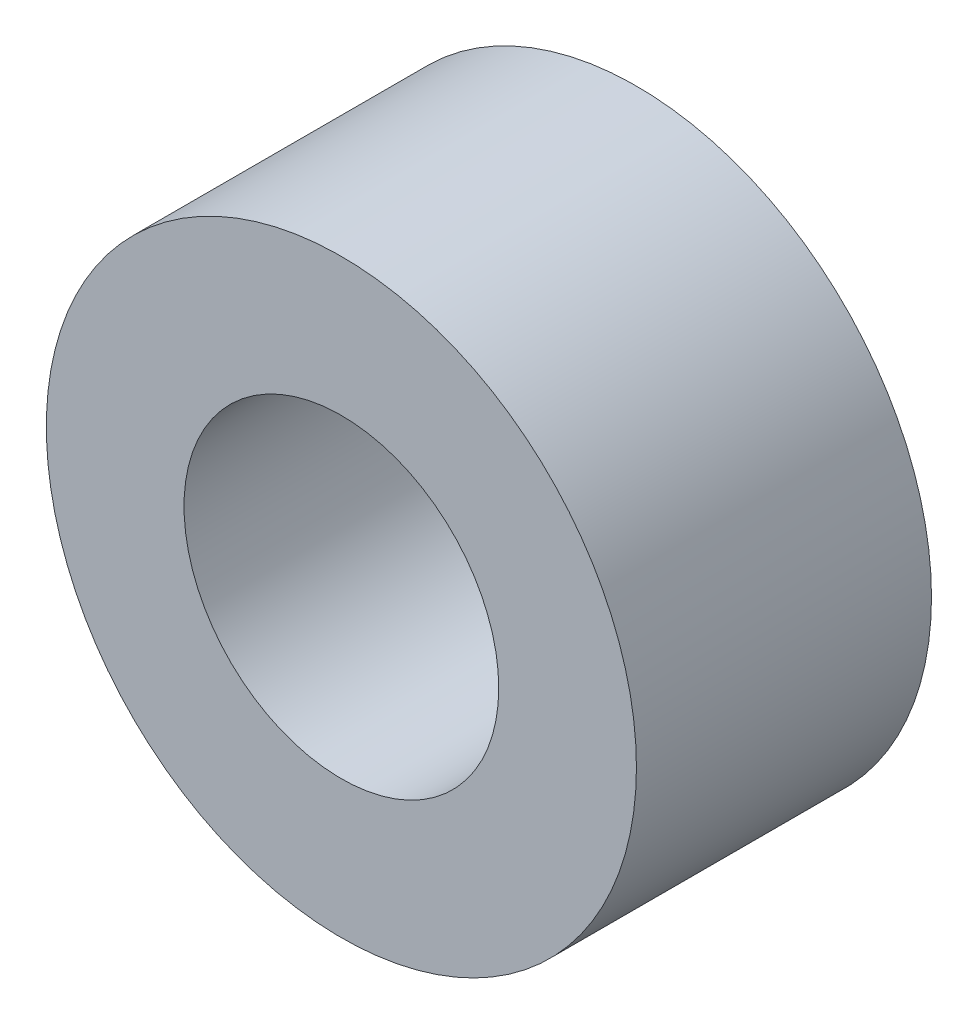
ISO-10303-21;
HEADER;
FILE_DESCRIPTION(('STEP AP214'),'2;1');
FILE_NAME('part.step','',(''),(''),'','','');
FILE_SCHEMA(('AUTOMOTIVE_DESIGN { 1 0 10303 214 1 1 1 1 }'));
ENDSEC;
DATA;
#1=APPLICATION_CONTEXT('core data for automotive mechanical design processes');
#2=APPLICATION_PROTOCOL_DEFINITION('international standard','automotive_design',2000,#1);
#3=PRODUCT_CONTEXT('',#1,'mechanical');
#4=PRODUCT('Part','Part','',(#3));
#5=PRODUCT_RELATED_PRODUCT_CATEGORY('part','',(#4));
#6=PRODUCT_DEFINITION_FORMATION('','',#4);
#7=PRODUCT_DEFINITION_CONTEXT('part definition',#1,'design');
#8=PRODUCT_DEFINITION('design','',#6,#7);
#9=PRODUCT_DEFINITION_SHAPE('','',#8);
#10=(LENGTH_UNIT() NAMED_UNIT(*) SI_UNIT(.MILLI.,.METRE.));
#11=(NAMED_UNIT(*) PLANE_ANGLE_UNIT() SI_UNIT($,.RADIAN.));
#12=(NAMED_UNIT(*) SI_UNIT($,.STERADIAN.) SOLID_ANGLE_UNIT());
#13=UNCERTAINTY_MEASURE_WITH_UNIT(LENGTH_MEASURE(1.E-05),#10,'distance_accuracy_value','');
#14=(GEOMETRIC_REPRESENTATION_CONTEXT(3) GLOBAL_UNCERTAINTY_ASSIGNED_CONTEXT((#13)) GLOBAL_UNIT_ASSIGNED_CONTEXT((#10,
#11,#12)) REPRESENTATION_CONTEXT('',''));
#15=CARTESIAN_POINT('',(0.,0.,0.));
#16=DIRECTION('',(0.,0.,1.));
#17=DIRECTION('',(1.,0.,0.));
#18=AXIS2_PLACEMENT_3D('',#15,#16,#17);
#19=CARTESIAN_POINT('',(0.,0.,3.75));
#20=DIRECTION('',(0.,0.,1.));
#21=DIRECTION('',(1.,0.,0.));
#22=AXIS2_PLACEMENT_3D('',#19,#20,#21);
#23=PLANE('',#22);
#24=CARTESIAN_POINT('',(0.,0.,3.75));
#25=DIRECTION('',(0.,0.,1.));
#26=DIRECTION('',(1.,0.,0.));
#27=AXIS2_PLACEMENT_3D('',#24,#25,#26);
#28=CIRCLE('',#27,7.5);
#29=CARTESIAN_POINT('',(7.5,0.,3.75));
#30=VERTEX_POINT('',#29);
#31=EDGE_CURVE('E10',#30,#30,#28,.T.);
#32=ORIENTED_EDGE('',*,*,#31,.T.);
#33=EDGE_LOOP('',(#32));
#34=FACE_BOUND('',#33,.T.);
#35=CARTESIAN_POINT('',(0.,0.,3.75));
#36=DIRECTION('',(0.,0.,1.));
#37=DIRECTION('',(1.,0.,0.));
#38=AXIS2_PLACEMENT_3D('',#35,#36,#37);
#39=CIRCLE('',#38,4.);
#40=CARTESIAN_POINT('',(4.,0.,3.75));
#41=VERTEX_POINT('',#40);
#42=EDGE_CURVE('E45',#41,#41,#39,.T.);
#43=ORIENTED_EDGE('',*,*,#42,.F.);
#44=EDGE_LOOP('',(#43));
#45=FACE_BOUND('',#44,.T.);
#46=ADVANCED_FACE('F34',(#34,#45),#23,.T.);
#47=CARTESIAN_POINT('',(0.,0.,-3.75));
#48=DIRECTION('',(0.,0.,1.));
#49=DIRECTION('',(1.,0.,0.));
#50=AXIS2_PLACEMENT_3D('',#47,#48,#49);
#51=PLANE('',#50);
#52=CARTESIAN_POINT('',(0.,0.,-3.75));
#53=DIRECTION('',(0.,0.,1.));
#54=DIRECTION('',(1.,0.,0.));
#55=AXIS2_PLACEMENT_3D('',#52,#53,#54);
#56=CIRCLE('',#55,7.5);
#57=CARTESIAN_POINT('',(7.5,0.,-3.75));
#58=VERTEX_POINT('',#57);
#59=EDGE_CURVE('E38',#58,#58,#56,.T.);
#60=ORIENTED_EDGE('',*,*,#59,.F.);
#61=EDGE_LOOP('',(#60));
#62=FACE_BOUND('',#61,.T.);
#63=CARTESIAN_POINT('',(0.,0.,-3.75));
#64=DIRECTION('',(0.,0.,1.));
#65=DIRECTION('',(1.,0.,0.));
#66=AXIS2_PLACEMENT_3D('',#63,#64,#65);
#67=CIRCLE('',#66,4.);
#68=CARTESIAN_POINT('',(4.,0.,-3.75));
#69=VERTEX_POINT('',#68);
#70=EDGE_CURVE('E47',#69,#69,#67,.T.);
#71=ORIENTED_EDGE('',*,*,#70,.T.);
#72=EDGE_LOOP('',(#71));
#73=FACE_BOUND('',#72,.T.);
#74=ADVANCED_FACE('F57',(#62,#73),#51,.F.);
#75=CARTESIAN_POINT('',(0.,0.,3.75));
#76=DIRECTION('',(0.,0.,-1.));
#77=DIRECTION('',(-1.,0.,0.));
#78=AXIS2_PLACEMENT_3D('',#75,#76,#77);
#79=CYLINDRICAL_SURFACE('',#78,7.5);
#80=ORIENTED_EDGE('',*,*,#31,.F.);
#81=EDGE_LOOP('',(#80));
#82=FACE_BOUND('',#81,.T.);
#83=ORIENTED_EDGE('',*,*,#59,.T.);
#84=EDGE_LOOP('',(#83));
#85=FACE_BOUND('',#84,.T.);
#86=ADVANCED_FACE('F36',(#82,#85),#79,.T.);
#87=CARTESIAN_POINT('',(0.,0.,3.75));
#88=DIRECTION('',(0.,0.,-1.));
#89=DIRECTION('',(-1.,0.,0.));
#90=AXIS2_PLACEMENT_3D('',#87,#88,#89);
#91=CYLINDRICAL_SURFACE('',#90,4.);
#92=ORIENTED_EDGE('',*,*,#42,.T.);
#93=EDGE_LOOP('',(#92));
#94=FACE_BOUND('',#93,.T.);
#95=ORIENTED_EDGE('',*,*,#70,.F.);
#96=EDGE_LOOP('',(#95));
#97=FACE_BOUND('',#96,.T.);
#98=ADVANCED_FACE('F53',(#94,#97),#91,.F.);
#99=CLOSED_SHELL('',(#46,#74,#86,#98));
#100=MANIFOLD_SOLID_BREP('B2',#99);
#101=ADVANCED_BREP_SHAPE_REPRESENTATION('',(#18,#100),#14);
#102=SHAPE_DEFINITION_REPRESENTATION(#9,#101);
ENDSEC;
END-ISO-10303-21;
